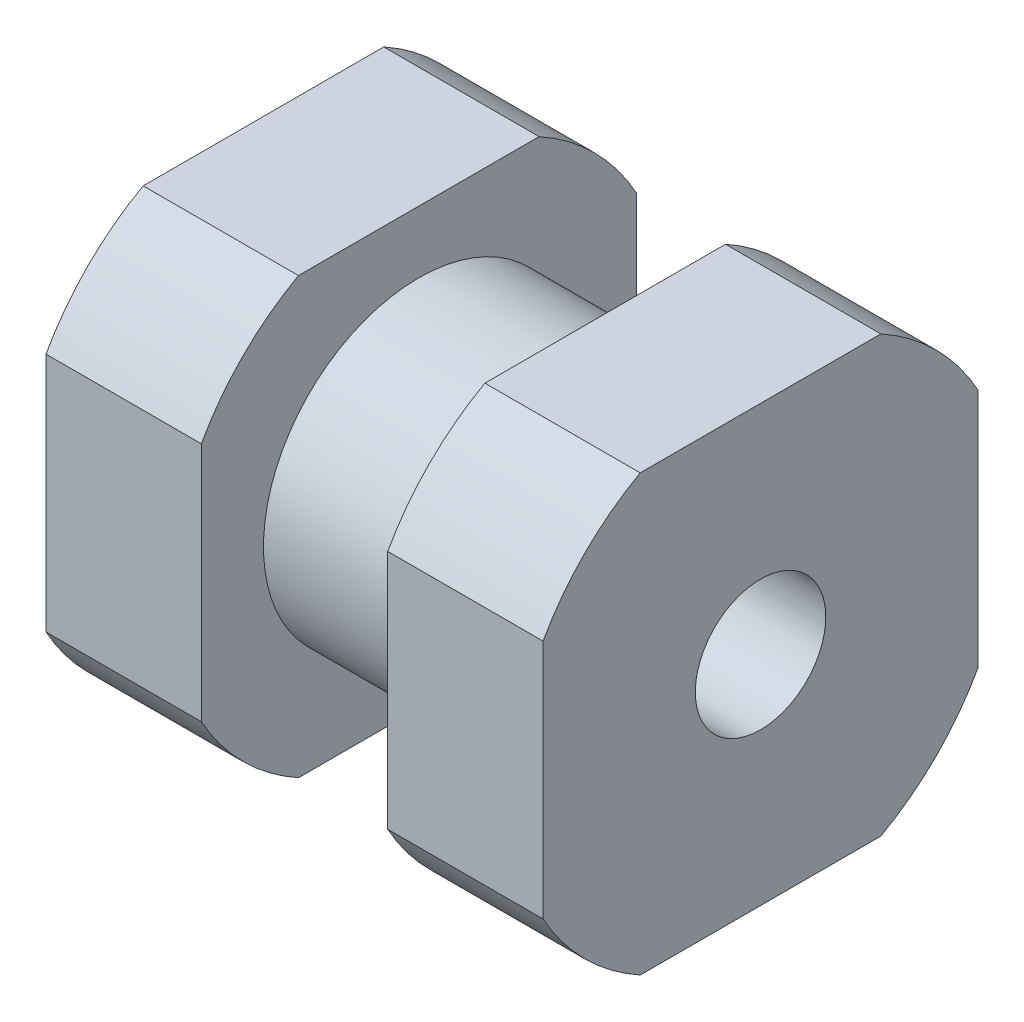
ISO-10303-21;
HEADER;
FILE_DESCRIPTION(('STEP AP214'),'2;1');
FILE_NAME('part.step','',(''),(''),'','','');
FILE_SCHEMA(('AUTOMOTIVE_DESIGN { 1 0 10303 214 1 1 1 1 }'));
ENDSEC;
DATA;
#1=APPLICATION_CONTEXT('core data for automotive mechanical design processes');
#2=APPLICATION_PROTOCOL_DEFINITION('international standard','automotive_design',2000,#1);
#3=PRODUCT_CONTEXT('',#1,'mechanical');
#4=PRODUCT('Part','Part','',(#3));
#5=PRODUCT_RELATED_PRODUCT_CATEGORY('part','',(#4));
#6=PRODUCT_DEFINITION_FORMATION('','',#4);
#7=PRODUCT_DEFINITION_CONTEXT('part definition',#1,'design');
#8=PRODUCT_DEFINITION('design','',#6,#7);
#9=PRODUCT_DEFINITION_SHAPE('','',#8);
#10=(LENGTH_UNIT() NAMED_UNIT(*) SI_UNIT(.MILLI.,.METRE.));
#11=(NAMED_UNIT(*) PLANE_ANGLE_UNIT() SI_UNIT($,.RADIAN.));
#12=(NAMED_UNIT(*) SI_UNIT($,.STERADIAN.) SOLID_ANGLE_UNIT());
#13=UNCERTAINTY_MEASURE_WITH_UNIT(LENGTH_MEASURE(1.E-05),#10,'distance_accuracy_value','');
#14=(GEOMETRIC_REPRESENTATION_CONTEXT(3) GLOBAL_UNCERTAINTY_ASSIGNED_CONTEXT((#13)) GLOBAL_UNIT_ASSIGNED_CONTEXT((#10,
#11,#12)) REPRESENTATION_CONTEXT('',''));
#15=CARTESIAN_POINT('',(0.,0.,0.));
#16=DIRECTION('',(0.,0.,1.));
#17=DIRECTION('',(1.,0.,0.));
#18=AXIS2_PLACEMENT_3D('',#15,#16,#17);
#19=CARTESIAN_POINT('',(324.720096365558,16.86,57.4927569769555));
#20=DIRECTION('',(1.,0.,0.));
#21=DIRECTION('',(0.,1.,0.));
#22=AXIS2_PLACEMENT_3D('',#19,#20,#21);
#23=PLANE('',#22);
#24=CARTESIAN_POINT('',(324.720096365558,16.86,57.4927569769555));
#25=DIRECTION('',(-1.,0.,0.));
#26=DIRECTION('',(0.,-1.,0.));
#27=AXIS2_PLACEMENT_3D('',#24,#25,#26);
#28=CIRCLE('',#27,5.);
#29=CARTESIAN_POINT('',(324.720096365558,11.86,57.4927569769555));
#30=VERTEX_POINT('',#29);
#31=EDGE_CURVE('E19',#30,#30,#28,.T.);
#32=ORIENTED_EDGE('',*,*,#31,.F.);
#33=EDGE_LOOP('',(#32));
#34=FACE_BOUND('',#33,.T.);
#35=CARTESIAN_POINT('',(324.720096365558,16.86,57.4927569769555));
#36=DIRECTION('',(1.,0.,0.));
#37=DIRECTION('',(0.,1.,0.));
#38=AXIS2_PLACEMENT_3D('',#35,#36,#37);
#39=CIRCLE('',#38,8.);
#40=CARTESIAN_POINT('',(324.720096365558,9.86,53.6197736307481));
#41=VERTEX_POINT('',#40);
#42=CARTESIAN_POINT('',(324.720096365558,12.9870166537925,50.4927569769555));
#43=VERTEX_POINT('',#42);
#44=EDGE_CURVE('E160',#41,#43,#39,.T.);
#45=ORIENTED_EDGE('',*,*,#44,.F.);
#46=DIRECTION('',(0.,0.,1.));
#47=VECTOR('',#46,1.);
#48=CARTESIAN_POINT('',(324.720096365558,9.86,64.4927569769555));
#49=LINE('',#48,#47);
#50=CARTESIAN_POINT('',(324.720096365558,9.86,61.3657403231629));
#51=VERTEX_POINT('',#50);
#52=EDGE_CURVE('E162',#51,#41,#49,.F.);
#53=ORIENTED_EDGE('',*,*,#52,.F.);
#54=CARTESIAN_POINT('',(324.720096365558,16.86,57.4927569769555));
#55=DIRECTION('',(1.,0.,0.));
#56=DIRECTION('',(0.,1.,0.));
#57=AXIS2_PLACEMENT_3D('',#54,#55,#56);
#58=CIRCLE('',#57,8.);
#59=CARTESIAN_POINT('',(324.720096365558,12.9870166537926,64.4927569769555));
#60=VERTEX_POINT('',#59);
#61=EDGE_CURVE('E136',#60,#51,#58,.T.);
#62=ORIENTED_EDGE('',*,*,#61,.F.);
#63=DIRECTION('',(0.,-1.,0.));
#64=VECTOR('',#63,1.);
#65=CARTESIAN_POINT('',(324.720096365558,23.86,64.4927569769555));
#66=LINE('',#65,#64);
#67=CARTESIAN_POINT('',(324.720096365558,20.7329833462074,64.4927569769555));
#68=VERTEX_POINT('',#67);
#69=EDGE_CURVE('E130',#68,#60,#66,.T.);
#70=ORIENTED_EDGE('',*,*,#69,.F.);
#71=CARTESIAN_POINT('',(324.720096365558,16.86,57.4927569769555));
#72=DIRECTION('',(1.,0.,0.));
#73=DIRECTION('',(0.,1.,0.));
#74=AXIS2_PLACEMENT_3D('',#71,#72,#73);
#75=CIRCLE('',#74,8.);
#76=CARTESIAN_POINT('',(324.720096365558,23.86,61.3657403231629));
#77=VERTEX_POINT('',#76);
#78=EDGE_CURVE('E133',#77,#68,#75,.T.);
#79=ORIENTED_EDGE('',*,*,#78,.F.);
#80=DIRECTION('',(0.,0.,1.));
#81=VECTOR('',#80,1.);
#82=CARTESIAN_POINT('',(324.720096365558,23.86,50.4927569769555));
#83=LINE('',#82,#81);
#84=CARTESIAN_POINT('',(324.720096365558,23.86,53.6197736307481));
#85=VERTEX_POINT('',#84);
#86=EDGE_CURVE('E125',#85,#77,#83,.T.);
#87=ORIENTED_EDGE('',*,*,#86,.F.);
#88=CARTESIAN_POINT('',(324.720096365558,16.86,57.4927569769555));
#89=DIRECTION('',(1.,0.,0.));
#90=DIRECTION('',(0.,1.,0.));
#91=AXIS2_PLACEMENT_3D('',#88,#89,#90);
#92=CIRCLE('',#91,8.);
#93=CARTESIAN_POINT('',(324.720096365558,20.7329833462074,50.4927569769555));
#94=VERTEX_POINT('',#93);
#95=EDGE_CURVE('E218',#94,#85,#92,.T.);
#96=ORIENTED_EDGE('',*,*,#95,.F.);
#97=DIRECTION('',(0.,1.,0.));
#98=VECTOR('',#97,1.);
#99=CARTESIAN_POINT('',(324.720096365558,9.85999999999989,50.4927569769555));
#100=LINE('',#99,#98);
#101=EDGE_CURVE('E157',#43,#94,#100,.T.);
#102=ORIENTED_EDGE('',*,*,#101,.F.);
#103=EDGE_LOOP('',(#45,#53,#62,#70,#79,#87,#96,#102));
#104=FACE_BOUND('',#103,.T.);
#105=ADVANCED_FACE('F16',(#34,#104),#23,.F.);
#106=CARTESIAN_POINT('',(324.720096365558,16.86,57.4927569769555));
#107=DIRECTION('',(-1.,0.,0.));
#108=DIRECTION('',(0.,-1.,0.));
#109=AXIS2_PLACEMENT_3D('',#106,#107,#108);
#110=CYLINDRICAL_SURFACE('',#109,5.);
#111=ORIENTED_EDGE('',*,*,#31,.T.);
#112=EDGE_LOOP('',(#111));
#113=FACE_BOUND('',#112,.T.);
#114=CARTESIAN_POINT('',(318.720096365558,16.86,57.4927569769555));
#115=DIRECTION('',(-1.,0.,0.));
#116=DIRECTION('',(0.,-1.,0.));
#117=AXIS2_PLACEMENT_3D('',#114,#115,#116);
#118=CIRCLE('',#117,5.);
#119=CARTESIAN_POINT('',(318.720096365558,11.86,57.4927569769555));
#120=VERTEX_POINT('',#119);
#121=EDGE_CURVE('E215',#120,#120,#118,.F.);
#122=ORIENTED_EDGE('',*,*,#121,.T.);
#123=EDGE_LOOP('',(#122));
#124=FACE_BOUND('',#123,.T.);
#125=ADVANCED_FACE('F476',(#113,#124),#110,.T.);
#126=CARTESIAN_POINT('',(331.320098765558,23.86,50.4927569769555));
#127=DIRECTION('',(0.,1.,0.));
#128=DIRECTION('',(-1.,0.,0.));
#129=AXIS2_PLACEMENT_3D('',#126,#127,#128);
#130=PLANE('',#129);
#131=DIRECTION('',(0.,0.,1.));
#132=VECTOR('',#131,1.);
#133=CARTESIAN_POINT('',(329.720096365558,23.86,57.4927569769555));
#134=LINE('',#133,#132);
#135=CARTESIAN_POINT('',(329.720096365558,23.86,53.6197736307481));
#136=VERTEX_POINT('',#135);
#137=CARTESIAN_POINT('',(329.720096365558,23.86,61.3657403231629));
#138=VERTEX_POINT('',#137);
#139=EDGE_CURVE('E214',#136,#138,#134,.T.);
#140=ORIENTED_EDGE('',*,*,#139,.F.);
#141=DIRECTION('',(1.,0.,0.));
#142=VECTOR('',#141,1.);
#143=CARTESIAN_POINT('',(324.720096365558,23.86,53.6197736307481));
#144=LINE('',#143,#142);
#145=EDGE_CURVE('E238',#85,#136,#144,.T.);
#146=ORIENTED_EDGE('',*,*,#145,.F.);
#147=ORIENTED_EDGE('',*,*,#86,.T.);
#148=DIRECTION('',(1.,0.,0.));
#149=VECTOR('',#148,1.);
#150=CARTESIAN_POINT('',(324.720096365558,23.86,61.3657403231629));
#151=LINE('',#150,#149);
#152=EDGE_CURVE('E146',#138,#77,#151,.F.);
#153=ORIENTED_EDGE('',*,*,#152,.F.);
#154=EDGE_LOOP('',(#140,#146,#147,#153));
#155=FACE_BOUND('',#154,.T.);
#156=ADVANCED_FACE('F468',(#155),#130,.T.);
#157=CARTESIAN_POINT('',(324.720096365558,16.86,57.4927569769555));
#158=DIRECTION('',(1.,0.,0.));
#159=DIRECTION('',(0.,1.,0.));
#160=AXIS2_PLACEMENT_3D('',#157,#158,#159);
#161=CYLINDRICAL_SURFACE('',#160,8.);
#162=ORIENTED_EDGE('',*,*,#152,.T.);
#163=ORIENTED_EDGE('',*,*,#78,.T.);
#164=DIRECTION('',(1.,0.,0.));
#165=VECTOR('',#164,1.);
#166=CARTESIAN_POINT('',(331.320098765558,20.7329833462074,64.4927569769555));
#167=LINE('',#166,#165);
#168=CARTESIAN_POINT('',(329.720096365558,20.7329833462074,64.4927569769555));
#169=VERTEX_POINT('',#168);
#170=EDGE_CURVE('E140',#169,#68,#167,.F.);
#171=ORIENTED_EDGE('',*,*,#170,.F.);
#172=CARTESIAN_POINT('',(329.720096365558,16.86,57.4927569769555));
#173=DIRECTION('',(1.,0.,0.));
#174=DIRECTION('',(0.,1.,0.));
#175=AXIS2_PLACEMENT_3D('',#172,#173,#174);
#176=CIRCLE('',#175,8.);
#177=EDGE_CURVE('E212',#138,#169,#176,.T.);
#178=ORIENTED_EDGE('',*,*,#177,.F.);
#179=EDGE_LOOP('',(#162,#163,#171,#178));
#180=FACE_BOUND('',#179,.T.);
#181=ADVANCED_FACE('F143',(#180),#161,.T.);
#182=CARTESIAN_POINT('',(331.320098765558,23.86,64.4927569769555));
#183=DIRECTION('',(0.,0.,1.));
#184=DIRECTION('',(0.,-1.,0.));
#185=AXIS2_PLACEMENT_3D('',#182,#183,#184);
#186=PLANE('',#185);
#187=DIRECTION('',(0.,1.,0.));
#188=VECTOR('',#187,1.);
#189=CARTESIAN_POINT('',(329.720096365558,16.86,64.4927569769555));
#190=LINE('',#189,#188);
#191=CARTESIAN_POINT('',(329.720096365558,12.9870166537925,64.4927569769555));
#192=VERTEX_POINT('',#191);
#193=EDGE_CURVE('E149',#169,#192,#190,.F.);
#194=ORIENTED_EDGE('',*,*,#193,.F.);
#195=ORIENTED_EDGE('',*,*,#170,.T.);
#196=ORIENTED_EDGE('',*,*,#69,.T.);
#197=DIRECTION('',(1.,0.,0.));
#198=VECTOR('',#197,1.);
#199=CARTESIAN_POINT('',(324.720096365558,12.9870166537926,64.4927569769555));
#200=LINE('',#199,#198);
#201=EDGE_CURVE('E151',#192,#60,#200,.F.);
#202=ORIENTED_EDGE('',*,*,#201,.F.);
#203=EDGE_LOOP('',(#194,#195,#196,#202));
#204=FACE_BOUND('',#203,.T.);
#205=ADVANCED_FACE('F147',(#204),#186,.T.);
#206=CARTESIAN_POINT('',(324.720096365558,16.86,57.4927569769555));
#207=DIRECTION('',(1.,0.,0.));
#208=DIRECTION('',(0.,1.,0.));
#209=AXIS2_PLACEMENT_3D('',#206,#207,#208);
#210=CYLINDRICAL_SURFACE('',#209,8.);
#211=ORIENTED_EDGE('',*,*,#201,.T.);
#212=ORIENTED_EDGE('',*,*,#61,.T.);
#213=DIRECTION('',(1.,0.,0.));
#214=VECTOR('',#213,1.);
#215=CARTESIAN_POINT('',(331.320098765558,9.86,61.3657403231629));
#216=LINE('',#215,#214);
#217=CARTESIAN_POINT('',(329.720096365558,9.86,61.3657403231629));
#218=VERTEX_POINT('',#217);
#219=EDGE_CURVE('E163',#218,#51,#216,.F.);
#220=ORIENTED_EDGE('',*,*,#219,.F.);
#221=CARTESIAN_POINT('',(329.720096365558,16.86,57.4927569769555));
#222=DIRECTION('',(1.,0.,0.));
#223=DIRECTION('',(0.,1.,0.));
#224=AXIS2_PLACEMENT_3D('',#221,#222,#223);
#225=CIRCLE('',#224,8.);
#226=EDGE_CURVE('E209',#192,#218,#225,.T.);
#227=ORIENTED_EDGE('',*,*,#226,.F.);
#228=EDGE_LOOP('',(#211,#212,#220,#227));
#229=FACE_BOUND('',#228,.T.);
#230=ADVANCED_FACE('F227',(#229),#210,.T.);
#231=CARTESIAN_POINT('',(331.320098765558,9.86,64.4927569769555));
#232=DIRECTION('',(0.,-1.,0.));
#233=DIRECTION('',(1.,0.,0.));
#234=AXIS2_PLACEMENT_3D('',#231,#232,#233);
#235=PLANE('',#234);
#236=DIRECTION('',(0.,0.,1.));
#237=VECTOR('',#236,1.);
#238=CARTESIAN_POINT('',(329.720096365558,9.86,57.4927569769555));
#239=LINE('',#238,#237);
#240=CARTESIAN_POINT('',(329.720096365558,9.86,53.6197736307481));
#241=VERTEX_POINT('',#240);
#242=EDGE_CURVE('E208',#218,#241,#239,.F.);
#243=ORIENTED_EDGE('',*,*,#242,.F.);
#244=ORIENTED_EDGE('',*,*,#219,.T.);
#245=ORIENTED_EDGE('',*,*,#52,.T.);
#246=DIRECTION('',(1.,0.,0.));
#247=VECTOR('',#246,1.);
#248=CARTESIAN_POINT('',(324.720096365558,9.86,53.6197736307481));
#249=LINE('',#248,#247);
#250=EDGE_CURVE('E224',#241,#41,#249,.F.);
#251=ORIENTED_EDGE('',*,*,#250,.F.);
#252=EDGE_LOOP('',(#243,#244,#245,#251));
#253=FACE_BOUND('',#252,.T.);
#254=ADVANCED_FACE('F231',(#253),#235,.T.);
#255=CARTESIAN_POINT('',(324.720096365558,16.86,57.4927569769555));
#256=DIRECTION('',(1.,0.,0.));
#257=DIRECTION('',(0.,1.,0.));
#258=AXIS2_PLACEMENT_3D('',#255,#256,#257);
#259=CYLINDRICAL_SURFACE('',#258,8.);
#260=ORIENTED_EDGE('',*,*,#250,.T.);
#261=ORIENTED_EDGE('',*,*,#44,.T.);
#262=DIRECTION('',(1.,0.,0.));
#263=VECTOR('',#262,1.);
#264=CARTESIAN_POINT('',(331.320098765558,12.9870166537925,50.4927569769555));
#265=LINE('',#264,#263);
#266=CARTESIAN_POINT('',(329.720096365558,12.9870166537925,50.4927569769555));
#267=VERTEX_POINT('',#266);
#268=EDGE_CURVE('E159',#267,#43,#265,.F.);
#269=ORIENTED_EDGE('',*,*,#268,.F.);
#270=CARTESIAN_POINT('',(329.720096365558,16.86,57.4927569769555));
#271=DIRECTION('',(1.,0.,0.));
#272=DIRECTION('',(0.,1.,0.));
#273=AXIS2_PLACEMENT_3D('',#270,#271,#272);
#274=CIRCLE('',#273,8.);
#275=EDGE_CURVE('E205',#241,#267,#274,.T.);
#276=ORIENTED_EDGE('',*,*,#275,.F.);
#277=EDGE_LOOP('',(#260,#261,#269,#276));
#278=FACE_BOUND('',#277,.T.);
#279=ADVANCED_FACE('F430',(#278),#259,.T.);
#280=CARTESIAN_POINT('',(331.320098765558,9.85999999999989,50.4927569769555));
#281=DIRECTION('',(0.,0.,-1.));
#282=DIRECTION('',(0.,1.,0.));
#283=AXIS2_PLACEMENT_3D('',#280,#281,#282);
#284=PLANE('',#283);
#285=DIRECTION('',(0.,1.,0.));
#286=VECTOR('',#285,1.);
#287=CARTESIAN_POINT('',(329.720096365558,16.86,50.4927569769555));
#288=LINE('',#287,#286);
#289=CARTESIAN_POINT('',(329.720096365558,20.7329833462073,50.4927569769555));
#290=VERTEX_POINT('',#289);
#291=EDGE_CURVE('E204',#267,#290,#288,.T.);
#292=ORIENTED_EDGE('',*,*,#291,.F.);
#293=ORIENTED_EDGE('',*,*,#268,.T.);
#294=ORIENTED_EDGE('',*,*,#101,.T.);
#295=DIRECTION('',(1.,0.,0.));
#296=VECTOR('',#295,1.);
#297=CARTESIAN_POINT('',(324.720096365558,20.7329833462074,50.4927569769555));
#298=LINE('',#297,#296);
#299=EDGE_CURVE('E221',#290,#94,#298,.F.);
#300=ORIENTED_EDGE('',*,*,#299,.F.);
#301=EDGE_LOOP('',(#292,#293,#294,#300));
#302=FACE_BOUND('',#301,.T.);
#303=ADVANCED_FACE('F421',(#302),#284,.T.);
#304=CARTESIAN_POINT('',(324.720096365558,16.86,57.4927569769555));
#305=DIRECTION('',(1.,0.,0.));
#306=DIRECTION('',(0.,1.,0.));
#307=AXIS2_PLACEMENT_3D('',#304,#305,#306);
#308=CYLINDRICAL_SURFACE('',#307,8.);
#309=ORIENTED_EDGE('',*,*,#299,.T.);
#310=ORIENTED_EDGE('',*,*,#95,.T.);
#311=ORIENTED_EDGE('',*,*,#145,.T.);
#312=CARTESIAN_POINT('',(329.720096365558,16.86,57.4927569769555));
#313=DIRECTION('',(1.,0.,0.));
#314=DIRECTION('',(0.,1.,0.));
#315=AXIS2_PLACEMENT_3D('',#312,#313,#314);
#316=CIRCLE('',#315,8.);
#317=EDGE_CURVE('E200',#290,#136,#316,.T.);
#318=ORIENTED_EDGE('',*,*,#317,.F.);
#319=EDGE_LOOP('',(#309,#310,#311,#318));
#320=FACE_BOUND('',#319,.T.);
#321=ADVANCED_FACE('F412',(#320),#308,.T.);
#322=CARTESIAN_POINT('',(318.720096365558,16.86,57.4927569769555));
#323=DIRECTION('',(-1.,0.,0.));
#324=DIRECTION('',(0.,-1.,0.));
#325=AXIS2_PLACEMENT_3D('',#322,#323,#324);
#326=PLANE('',#325);
#327=ORIENTED_EDGE('',*,*,#121,.F.);
#328=EDGE_LOOP('',(#327));
#329=FACE_BOUND('',#328,.T.);
#330=CARTESIAN_POINT('',(318.720096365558,16.86,57.4927569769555));
#331=DIRECTION('',(-1.,0.,0.));
#332=DIRECTION('',(0.,-1.,0.));
#333=AXIS2_PLACEMENT_3D('',#330,#331,#332);
#334=CIRCLE('',#333,8.);
#335=CARTESIAN_POINT('',(318.720096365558,20.7329833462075,64.4927569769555));
#336=VERTEX_POINT('',#335);
#337=CARTESIAN_POINT('',(318.720096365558,23.86,61.3657403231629));
#338=VERTEX_POINT('',#337);
#339=EDGE_CURVE('E191',#336,#338,#334,.T.);
#340=ORIENTED_EDGE('',*,*,#339,.F.);
#341=DIRECTION('',(0.,-1.,0.));
#342=VECTOR('',#341,1.);
#343=CARTESIAN_POINT('',(318.720096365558,23.86,64.4927569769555));
#344=LINE('',#343,#342);
#345=CARTESIAN_POINT('',(318.720096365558,12.9870166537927,64.4927569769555));
#346=VERTEX_POINT('',#345);
#347=EDGE_CURVE('E243',#346,#336,#344,.F.);
#348=ORIENTED_EDGE('',*,*,#347,.F.);
#349=CARTESIAN_POINT('',(318.720096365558,16.86,57.4927569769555));
#350=DIRECTION('',(-1.,0.,0.));
#351=DIRECTION('',(0.,-1.,0.));
#352=AXIS2_PLACEMENT_3D('',#349,#350,#351);
#353=CIRCLE('',#352,8.);
#354=CARTESIAN_POINT('',(318.720096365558,9.86,61.3657403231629));
#355=VERTEX_POINT('',#354);
#356=EDGE_CURVE('E196',#355,#346,#353,.T.);
#357=ORIENTED_EDGE('',*,*,#356,.F.);
#358=DIRECTION('',(0.,0.,1.));
#359=VECTOR('',#358,1.);
#360=CARTESIAN_POINT('',(318.720096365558,9.86,64.4927569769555));
#361=LINE('',#360,#359);
#362=CARTESIAN_POINT('',(318.720096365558,9.86,53.6197736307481));
#363=VERTEX_POINT('',#362);
#364=EDGE_CURVE('E203',#363,#355,#361,.T.);
#365=ORIENTED_EDGE('',*,*,#364,.F.);
#366=CARTESIAN_POINT('',(318.720096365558,16.86,57.4927569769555));
#367=DIRECTION('',(-1.,0.,0.));
#368=DIRECTION('',(0.,-1.,0.));
#369=AXIS2_PLACEMENT_3D('',#366,#367,#368);
#370=CIRCLE('',#369,8.);
#371=CARTESIAN_POINT('',(318.720096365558,12.9870166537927,50.4927569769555));
#372=VERTEX_POINT('',#371);
#373=EDGE_CURVE('E183',#372,#363,#370,.T.);
#374=ORIENTED_EDGE('',*,*,#373,.F.);
#375=DIRECTION('',(0.,1.,0.));
#376=VECTOR('',#375,1.);
#377=CARTESIAN_POINT('',(318.720096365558,9.85999999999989,50.4927569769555));
#378=LINE('',#377,#376);
#379=CARTESIAN_POINT('',(318.720096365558,20.7329833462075,50.4927569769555));
#380=VERTEX_POINT('',#379);
#381=EDGE_CURVE('E189',#380,#372,#378,.F.);
#382=ORIENTED_EDGE('',*,*,#381,.F.);
#383=CARTESIAN_POINT('',(318.720096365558,16.86,57.4927569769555));
#384=DIRECTION('',(-1.,0.,0.));
#385=DIRECTION('',(0.,-1.,0.));
#386=AXIS2_PLACEMENT_3D('',#383,#384,#385);
#387=CIRCLE('',#386,8.);
#388=CARTESIAN_POINT('',(318.720096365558,23.86,53.6197736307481));
#389=VERTEX_POINT('',#388);
#390=EDGE_CURVE('E186',#389,#380,#387,.T.);
#391=ORIENTED_EDGE('',*,*,#390,.F.);
#392=DIRECTION('',(0.,0.,1.));
#393=VECTOR('',#392,1.);
#394=CARTESIAN_POINT('',(318.720096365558,23.86,50.4927569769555));
#395=LINE('',#394,#393);
#396=EDGE_CURVE('E194',#338,#389,#395,.F.);
#397=ORIENTED_EDGE('',*,*,#396,.F.);
#398=EDGE_LOOP('',(#340,#348,#357,#365,#374,#382,#391,#397));
#399=FACE_BOUND('',#398,.T.);
#400=ADVANCED_FACE('F289',(#329,#399),#326,.F.);
#401=CARTESIAN_POINT('',(329.720096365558,16.86,57.4927569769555));
#402=DIRECTION('',(1.,0.,0.));
#403=DIRECTION('',(0.,1.,0.));
#404=AXIS2_PLACEMENT_3D('',#401,#402,#403);
#405=PLANE('',#404);
#406=CARTESIAN_POINT('',(329.720096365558,16.86,57.4927569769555));
#407=DIRECTION('',(-1.,0.,0.));
#408=DIRECTION('',(0.,-1.,0.));
#409=AXIS2_PLACEMENT_3D('',#406,#407,#408);
#410=CIRCLE('',#409,2.1);
#411=CARTESIAN_POINT('',(329.720096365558,14.76,57.4927569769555));
#412=VERTEX_POINT('',#411);
#413=EDGE_CURVE('E180',#412,#412,#410,.T.);
#414=ORIENTED_EDGE('',*,*,#413,.T.);
#415=EDGE_LOOP('',(#414));
#416=FACE_BOUND('',#415,.T.);
#417=ORIENTED_EDGE('',*,*,#291,.T.);
#418=ORIENTED_EDGE('',*,*,#317,.T.);
#419=ORIENTED_EDGE('',*,*,#139,.T.);
#420=ORIENTED_EDGE('',*,*,#177,.T.);
#421=ORIENTED_EDGE('',*,*,#193,.T.);
#422=ORIENTED_EDGE('',*,*,#226,.T.);
#423=ORIENTED_EDGE('',*,*,#242,.T.);
#424=ORIENTED_EDGE('',*,*,#275,.T.);
#425=EDGE_LOOP('',(#417,#418,#419,#420,#421,#422,#423,#424));
#426=FACE_BOUND('',#425,.T.);
#427=ADVANCED_FACE('F396',(#416,#426),#405,.T.);
#428=CARTESIAN_POINT('',(331.320098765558,9.86,64.4927569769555));
#429=DIRECTION('',(0.,-1.,0.));
#430=DIRECTION('',(1.,0.,0.));
#431=AXIS2_PLACEMENT_3D('',#428,#429,#430);
#432=PLANE('',#431);
#433=DIRECTION('',(-1.,0.,0.));
#434=VECTOR('',#433,1.);
#435=CARTESIAN_POINT('',(318.720096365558,9.86,61.3657403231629));
#436=LINE('',#435,#434);
#437=CARTESIAN_POINT('',(313.720096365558,9.86000000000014,61.3657403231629));
#438=VERTEX_POINT('',#437);
#439=EDGE_CURVE('E199',#438,#355,#436,.F.);
#440=ORIENTED_EDGE('',*,*,#439,.F.);
#441=DIRECTION('',(0.,0.,1.));
#442=VECTOR('',#441,1.);
#443=CARTESIAN_POINT('',(313.720096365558,9.86000000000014,57.4927569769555));
#444=LINE('',#443,#442);
#445=CARTESIAN_POINT('',(313.720096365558,9.86000000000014,53.6197736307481));
#446=VERTEX_POINT('',#445);
#447=EDGE_CURVE('E179',#446,#438,#444,.T.);
#448=ORIENTED_EDGE('',*,*,#447,.F.);
#449=DIRECTION('',(-1.,0.,0.));
#450=VECTOR('',#449,1.);
#451=CARTESIAN_POINT('',(318.720096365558,9.86,53.6197736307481));
#452=LINE('',#451,#450);
#453=EDGE_CURVE('E268',#363,#446,#452,.T.);
#454=ORIENTED_EDGE('',*,*,#453,.F.);
#455=ORIENTED_EDGE('',*,*,#364,.T.);
#456=EDGE_LOOP('',(#440,#448,#454,#455));
#457=FACE_BOUND('',#456,.T.);
#458=ADVANCED_FACE('F295',(#457),#432,.T.);
#459=CARTESIAN_POINT('',(318.720096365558,16.86,57.4927569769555));
#460=DIRECTION('',(-1.,0.,0.));
#461=DIRECTION('',(0.,-1.,0.));
#462=AXIS2_PLACEMENT_3D('',#459,#460,#461);
#463=CYLINDRICAL_SURFACE('',#462,8.);
#464=DIRECTION('',(1.,0.,0.));
#465=VECTOR('',#464,1.);
#466=CARTESIAN_POINT('',(331.320098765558,12.9870166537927,64.4927569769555));
#467=LINE('',#466,#465);
#468=CARTESIAN_POINT('',(313.720096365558,12.9870166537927,64.4927569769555));
#469=VERTEX_POINT('',#468);
#470=EDGE_CURVE('E198',#469,#346,#467,.T.);
#471=ORIENTED_EDGE('',*,*,#470,.F.);
#472=CARTESIAN_POINT('',(313.720096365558,16.86,57.4927569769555));
#473=DIRECTION('',(-1.,0.,0.));
#474=DIRECTION('',(0.,-1.,0.));
#475=AXIS2_PLACEMENT_3D('',#472,#473,#474);
#476=CIRCLE('',#475,8.);
#477=EDGE_CURVE('E176',#438,#469,#476,.T.);
#478=ORIENTED_EDGE('',*,*,#477,.F.);
#479=ORIENTED_EDGE('',*,*,#439,.T.);
#480=ORIENTED_EDGE('',*,*,#356,.T.);
#481=EDGE_LOOP('',(#471,#478,#479,#480));
#482=FACE_BOUND('',#481,.T.);
#483=ADVANCED_FACE('F299',(#482),#463,.T.);
#484=CARTESIAN_POINT('',(331.320098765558,23.86,64.4927569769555));
#485=DIRECTION('',(0.,0.,1.));
#486=DIRECTION('',(0.,-1.,0.));
#487=AXIS2_PLACEMENT_3D('',#484,#485,#486);
#488=PLANE('',#487);
#489=DIRECTION('',(-1.,0.,0.));
#490=VECTOR('',#489,1.);
#491=CARTESIAN_POINT('',(318.720096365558,20.7329833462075,64.4927569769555));
#492=LINE('',#491,#490);
#493=CARTESIAN_POINT('',(313.720096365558,20.7329833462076,64.4927569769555));
#494=VERTEX_POINT('',#493);
#495=EDGE_CURVE('E195',#494,#336,#492,.F.);
#496=ORIENTED_EDGE('',*,*,#495,.F.);
#497=DIRECTION('',(0.,-1.,0.));
#498=VECTOR('',#497,1.);
#499=CARTESIAN_POINT('',(313.720096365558,16.86,64.4927569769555));
#500=LINE('',#499,#498);
#501=EDGE_CURVE('E175',#469,#494,#500,.F.);
#502=ORIENTED_EDGE('',*,*,#501,.F.);
#503=ORIENTED_EDGE('',*,*,#470,.T.);
#504=ORIENTED_EDGE('',*,*,#347,.T.);
#505=EDGE_LOOP('',(#496,#502,#503,#504));
#506=FACE_BOUND('',#505,.T.);
#507=ADVANCED_FACE('F302',(#506),#488,.T.);
#508=CARTESIAN_POINT('',(318.720096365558,16.86,57.4927569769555));
#509=DIRECTION('',(-1.,0.,0.));
#510=DIRECTION('',(0.,-1.,0.));
#511=AXIS2_PLACEMENT_3D('',#508,#509,#510);
#512=CYLINDRICAL_SURFACE('',#511,8.);
#513=ORIENTED_EDGE('',*,*,#495,.T.);
#514=ORIENTED_EDGE('',*,*,#339,.T.);
#515=DIRECTION('',(-1.,0.,0.));
#516=VECTOR('',#515,1.);
#517=CARTESIAN_POINT('',(331.320098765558,23.86,61.3657403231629));
#518=LINE('',#517,#516);
#519=CARTESIAN_POINT('',(313.720096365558,23.86,61.365740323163));
#520=VERTEX_POINT('',#519);
#521=EDGE_CURVE('E246',#520,#338,#518,.F.);
#522=ORIENTED_EDGE('',*,*,#521,.F.);
#523=CARTESIAN_POINT('',(313.720096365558,16.86,57.4927569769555));
#524=DIRECTION('',(-1.,0.,0.));
#525=DIRECTION('',(0.,-1.,0.));
#526=AXIS2_PLACEMENT_3D('',#523,#524,#525);
#527=CIRCLE('',#526,8.);
#528=EDGE_CURVE('E172',#494,#520,#527,.T.);
#529=ORIENTED_EDGE('',*,*,#528,.F.);
#530=EDGE_LOOP('',(#513,#514,#522,#529));
#531=FACE_BOUND('',#530,.T.);
#532=ADVANCED_FACE('F305',(#531),#512,.T.);
#533=CARTESIAN_POINT('',(331.320098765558,23.86,50.4927569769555));
#534=DIRECTION('',(0.,1.,0.));
#535=DIRECTION('',(-1.,0.,0.));
#536=AXIS2_PLACEMENT_3D('',#533,#534,#535);
#537=PLANE('',#536);
#538=DIRECTION('',(0.,0.,1.));
#539=VECTOR('',#538,1.);
#540=CARTESIAN_POINT('',(313.720096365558,23.86,57.4927569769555));
#541=LINE('',#540,#539);
#542=CARTESIAN_POINT('',(313.720096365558,23.86,53.619773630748));
#543=VERTEX_POINT('',#542);
#544=EDGE_CURVE('E171',#520,#543,#541,.F.);
#545=ORIENTED_EDGE('',*,*,#544,.F.);
#546=ORIENTED_EDGE('',*,*,#521,.T.);
#547=ORIENTED_EDGE('',*,*,#396,.T.);
#548=DIRECTION('',(-1.,0.,0.));
#549=VECTOR('',#548,1.);
#550=CARTESIAN_POINT('',(318.720096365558,23.86,53.6197736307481));
#551=LINE('',#550,#549);
#552=EDGE_CURVE('E190',#543,#389,#551,.F.);
#553=ORIENTED_EDGE('',*,*,#552,.F.);
#554=EDGE_LOOP('',(#545,#546,#547,#553));
#555=FACE_BOUND('',#554,.T.);
#556=ADVANCED_FACE('F308',(#555),#537,.T.);
#557=CARTESIAN_POINT('',(318.720096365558,16.86,57.4927569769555));
#558=DIRECTION('',(-1.,0.,0.));
#559=DIRECTION('',(0.,-1.,0.));
#560=AXIS2_PLACEMENT_3D('',#557,#558,#559);
#561=CYLINDRICAL_SURFACE('',#560,8.);
#562=DIRECTION('',(1.,0.,0.));
#563=VECTOR('',#562,1.);
#564=CARTESIAN_POINT('',(331.320098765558,20.7329833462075,50.4927569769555));
#565=LINE('',#564,#563);
#566=CARTESIAN_POINT('',(313.720096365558,20.7329833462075,50.4927569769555));
#567=VERTEX_POINT('',#566);
#568=EDGE_CURVE('E249',#567,#380,#565,.T.);
#569=ORIENTED_EDGE('',*,*,#568,.F.);
#570=CARTESIAN_POINT('',(313.720096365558,16.86,57.4927569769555));
#571=DIRECTION('',(-1.,0.,0.));
#572=DIRECTION('',(0.,-1.,0.));
#573=AXIS2_PLACEMENT_3D('',#570,#571,#572);
#574=CIRCLE('',#573,8.);
#575=EDGE_CURVE('E168',#543,#567,#574,.T.);
#576=ORIENTED_EDGE('',*,*,#575,.F.);
#577=ORIENTED_EDGE('',*,*,#552,.T.);
#578=ORIENTED_EDGE('',*,*,#390,.T.);
#579=EDGE_LOOP('',(#569,#576,#577,#578));
#580=FACE_BOUND('',#579,.T.);
#581=ADVANCED_FACE('F285',(#580),#561,.T.);
#582=CARTESIAN_POINT('',(331.320098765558,9.85999999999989,50.4927569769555));
#583=DIRECTION('',(0.,0.,-1.));
#584=DIRECTION('',(0.,1.,0.));
#585=AXIS2_PLACEMENT_3D('',#582,#583,#584);
#586=PLANE('',#585);
#587=DIRECTION('',(0.,-1.,0.));
#588=VECTOR('',#587,1.);
#589=CARTESIAN_POINT('',(313.720096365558,16.86,50.4927569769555));
#590=LINE('',#589,#588);
#591=CARTESIAN_POINT('',(313.720096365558,12.9870166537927,50.4927569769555));
#592=VERTEX_POINT('',#591);
#593=EDGE_CURVE('E167',#567,#592,#590,.T.);
#594=ORIENTED_EDGE('',*,*,#593,.F.);
#595=ORIENTED_EDGE('',*,*,#568,.T.);
#596=ORIENTED_EDGE('',*,*,#381,.T.);
#597=DIRECTION('',(-1.,0.,0.));
#598=VECTOR('',#597,1.);
#599=CARTESIAN_POINT('',(318.720096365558,12.9870166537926,50.4927569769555));
#600=LINE('',#599,#598);
#601=EDGE_CURVE('E34',#592,#372,#600,.F.);
#602=ORIENTED_EDGE('',*,*,#601,.F.);
#603=EDGE_LOOP('',(#594,#595,#596,#602));
#604=FACE_BOUND('',#603,.T.);
#605=ADVANCED_FACE('F282',(#604),#586,.T.);
#606=CARTESIAN_POINT('',(318.720096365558,16.86,57.4927569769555));
#607=DIRECTION('',(-1.,0.,0.));
#608=DIRECTION('',(0.,-1.,0.));
#609=AXIS2_PLACEMENT_3D('',#606,#607,#608);
#610=CYLINDRICAL_SURFACE('',#609,8.);
#611=ORIENTED_EDGE('',*,*,#601,.T.);
#612=ORIENTED_EDGE('',*,*,#373,.T.);
#613=ORIENTED_EDGE('',*,*,#453,.T.);
#614=CARTESIAN_POINT('',(313.720096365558,16.86,57.4927569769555));
#615=DIRECTION('',(-1.,0.,0.));
#616=DIRECTION('',(0.,-1.,0.));
#617=AXIS2_PLACEMENT_3D('',#614,#615,#616);
#618=CIRCLE('',#617,8.);
#619=EDGE_CURVE('E25',#592,#446,#618,.T.);
#620=ORIENTED_EDGE('',*,*,#619,.F.);
#621=EDGE_LOOP('',(#611,#612,#613,#620));
#622=FACE_BOUND('',#621,.T.);
#623=ADVANCED_FACE('F293',(#622),#610,.T.);
#624=CARTESIAN_POINT('',(313.720096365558,16.86,57.4927569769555));
#625=DIRECTION('',(-1.,0.,0.));
#626=DIRECTION('',(0.,-1.,0.));
#627=AXIS2_PLACEMENT_3D('',#624,#625,#626);
#628=CYLINDRICAL_SURFACE('',#627,2.1);
#629=CARTESIAN_POINT('',(313.720096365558,16.86,57.4927569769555));
#630=DIRECTION('',(-1.,0.,0.));
#631=DIRECTION('',(0.,-1.,0.));
#632=AXIS2_PLACEMENT_3D('',#629,#630,#631);
#633=CIRCLE('',#632,2.1);
#634=CARTESIAN_POINT('',(313.720096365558,14.76,57.4927569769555));
#635=VERTEX_POINT('',#634);
#636=EDGE_CURVE('E11',#635,#635,#633,.F.);
#637=ORIENTED_EDGE('',*,*,#636,.F.);
#638=EDGE_LOOP('',(#637));
#639=FACE_BOUND('',#638,.T.);
#640=ORIENTED_EDGE('',*,*,#413,.F.);
#641=EDGE_LOOP('',(#640));
#642=FACE_BOUND('',#641,.T.);
#643=ADVANCED_FACE('F320',(#639,#642),#628,.F.);
#644=CARTESIAN_POINT('',(313.720096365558,16.86,57.4927569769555));
#645=DIRECTION('',(-1.,0.,0.));
#646=DIRECTION('',(0.,-1.,0.));
#647=AXIS2_PLACEMENT_3D('',#644,#645,#646);
#648=PLANE('',#647);
#649=ORIENTED_EDGE('',*,*,#636,.T.);
#650=EDGE_LOOP('',(#649));
#651=FACE_BOUND('',#650,.T.);
#652=ORIENTED_EDGE('',*,*,#593,.T.);
#653=ORIENTED_EDGE('',*,*,#619,.T.);
#654=ORIENTED_EDGE('',*,*,#447,.T.);
#655=ORIENTED_EDGE('',*,*,#477,.T.);
#656=ORIENTED_EDGE('',*,*,#501,.T.);
#657=ORIENTED_EDGE('',*,*,#528,.T.);
#658=ORIENTED_EDGE('',*,*,#544,.T.);
#659=ORIENTED_EDGE('',*,*,#575,.T.);
#660=EDGE_LOOP('',(#652,#653,#654,#655,#656,#657,#658,#659));
#661=FACE_BOUND('',#660,.T.);
#662=ADVANCED_FACE('F280',(#651,#661),#648,.T.);
#663=CLOSED_SHELL('',(#105,#125,#156,#181,#205,#230,#254,#279,#303,#321,#400,#427,#458,#483,
#507,#532,#556,#581,#605,#623,#643,#662));
#664=MANIFOLD_SOLID_BREP('B1',#663);
#665=ADVANCED_BREP_SHAPE_REPRESENTATION('',(#18,#664),#14);
#666=SHAPE_DEFINITION_REPRESENTATION(#9,#665);
ENDSEC;
END-ISO-10303-21;
